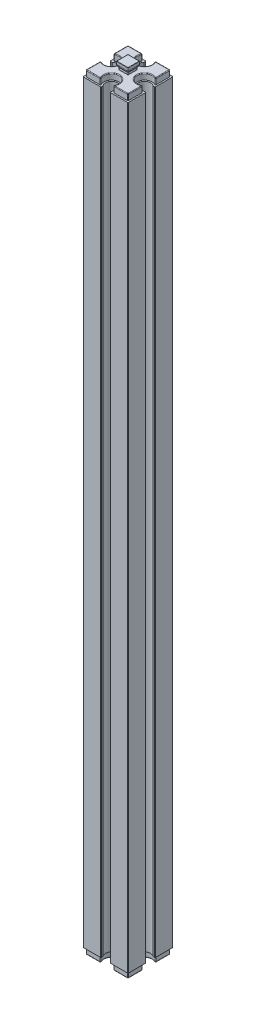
from build123d import *

# Parameters (mm, degrees)
EXTRUDE_1_DEPTH        = 125.5
EXTRUDE_2_DEPTH        = 2
EXTRUDE_3_DEPTH        = 2
FILLET_3_R             = 0.2
CUT_EXTRUDE_1_DEPTH    = 3
FILLET_4_R             = 0.2
FILLET_5_R             = 0.1
FILLET_3_OF_MIRROR_1_R = 0.2
FILLET_4_OF_MIRROR_1_R = 0.2
FILLET_5_OF_MIRROR_1_R = 0.1


with BuildPart() as part:
    # Sketch 1 → Extrude 1 (new body)
    with BuildSketch(Plane(origin=(0, 0, 0), x_dir=(1, 0, 0), z_dir=(0, 1, 0))):
        with BuildLine():
            Line((-7.5, 7.5), (-1.5, 7.5))
            Line((-1.5, 7.5), (-1.5, 6.822875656))
            ThreePointArc((-1.5, 6.822875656), (0, 3.5), (1.5, 6.822875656))
            Line((1.5, 6.822875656), (1.5, 7.5))
            Line((1.5, 7.5), (7.5, 7.5))
            Line((7.5, 7.5), (7.5, 1.5))
            Line((7.5, 1.5), (6.822875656, 1.5))
            ThreePointArc((6.822875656, 1.5), (3.5, 0), (6.822875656, -1.5))
            Line((6.822875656, -1.5), (7.5, -1.5))
            Line((7.5, -1.5), (7.5, -7.5))
            Line((7.5, -7.5), (1.5, -7.5))
            Line((1.5, -7.5), (1.5, -6.822875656))
            ThreePointArc((1.5, -6.822875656), (0, -3.5), (-1.5, -6.822875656))
            Line((-1.5, -6.822875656), (-1.5, -7.5))
            Line((-1.5, -7.5), (-7.5, -7.5))
            Line((-7.5, -7.5), (-7.5, -1.5))
            Line((-7.5, -1.5), (-6.822875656, -1.5))
            ThreePointArc((-6.822875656, -1.5), (-3.5, 0), (-6.822875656, 1.5))
            Line((-6.822875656, 1.5), (-7.5, 1.5))
            Line((-7.5, 1.5), (-7.5, 7.5))
        make_face()
    extrude_1 = extrude(amount=EXTRUDE_1_DEPTH)

    # Sketch 2 → Extrude 2 (add)
    with BuildSketch(Plane(origin=(0, 125.5, 0), x_dir=(1, 0, 0), z_dir=(0, 1, 0))):
        with BuildLine():
            Line((-7, 7), (-7, 2))
            ThreePointArc((-7, 2), (-3, 0), (-7, -2))
            Line((-7, -2), (-7, -7))
            Line((-7, -7), (-2, -7))
            ThreePointArc((-2, -7), (0, -3), (2, -7))
            Line((2, -7), (7, -7))
            Line((7, -7), (7, -2))
            ThreePointArc((7, -2), (3, 0), (7, 2))
            Line((7, 2), (7, 7))
            Line((7, 7), (2, 7))
            ThreePointArc((2, 7), (0, 3), (-2, 7))
            Line((-2, 7), (-7, 7))
        make_face()
    extrude_2 = extrude(amount=EXTRUDE_2_DEPTH)

    # Sketch 3 → Extrude 3 (add, symmetric)
    with BuildSketch(Plane(origin=(0, 0, 0), x_dir=(0, 0, -1), z_dir=(1, 0, 0))):
        with BuildLine():
            Line((-1.5, 127.5), (1.5, 127.5))
            Line((1.5, 127.5), (1.5, 128.177124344))
            ThreePointArc((1.5, 128.177124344), (1.780042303, 128.588161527), (1.95, 129.055590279))
            Line((1.95, 129.055590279), (1.95, 130))
            Line((1.95, 130), (-1.95, 130))
            Line((-1.95, 130), (-1.95, 129.055590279))
            ThreePointArc((-1.95, 129.055590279), (-1.780042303, 128.588161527), (-1.5, 128.177124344))
            Line((-1.5, 128.177124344), (-1.5, 127.5))
        make_face()
    extrude_3 = extrude(amount=EXTRUDE_3_DEPTH, both=True)

    # Fillet 3
    fillet_3_edges = [part.edges().sort_by_distance(p)[0] for p in [
        (-7.5, 62.75, -7.5),
        (-1.5, 62.75, -7.5),
        (1.5, 62.75, -7.5),
        (7.5, 62.75, -7.5),
        (7.5, 62.75, -1.5),
        (7.5, 62.75, 1.5),
        (7.5, 62.75, 7.5),
        (1.5, 62.75, 7.5),
        (-1.5, 62.75, 7.5),
        (-7.5, 62.75, 7.5),
        (-7.5, 62.75, 1.5),
        (-6.822875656, 62.75, -1.5),
        (-7.5, 62.75, -1.5),
    ]]
    fillet(fillet_3_edges, radius=FILLET_3_R)

    # Sketch 4 → Cut-Extrude 1 (cut, symmetric)
    with BuildSketch(Plane.XY):
        with BuildLine():
            Line((1.95, 130), (2, 130))
            Line((2, 130), (2, 127.5))
            Line((2, 127.5), (1.5, 127.5))
            Line((1.5, 127.5), (1.5, 128.177124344))
            ThreePointArc((1.5, 128.177124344), (1.780042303, 128.588161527), (1.95, 129.055590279))
            Line((1.95, 129.055590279), (1.95, 130))
        make_face()
        with BuildLine():
            Line((-1.95, 130), (-1.95, 129.055590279))
            ThreePointArc((-1.95, 129.055590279), (-1.780042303, 128.588161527), (-1.5, 128.177124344))
            Line((-1.5, 128.177124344), (-1.5, 127.5))
            Line((-1.5, 127.5), (-2, 127.5))
            Line((-2, 127.5), (-2, 130))
            Line((-2, 130), (-1.95, 130))
        make_face()
    cut_extrude_1 = extrude(amount=CUT_EXTRUDE_1_DEPTH, both=True, mode=Mode.SUBTRACT)

    # Fillet 4
    fillet_4_edges = [part.edges().sort_by_distance(p)[0] for p in [
        (-2, 126.5, -7),
        (-7, 126.5, -7),
        (-7, 126.5, -2),
        (-7, 126.5, 2),
        (-7, 126.5, 7),
        (-2, 126.5, 7),
        (2, 126.5, 7),
        (7, 126.5, 7),
        (7, 126.5, 2),
        (7, 126.5, -2),
        (7, 126.5, -7),
        (2, 126.5, -7),
        (-4.5, 127.5, -7),
        (-7, 127.5, -4.5),
        (-3, 127.5, 0),
        (-7, 127.5, 4.5),
        (-4.5, 127.5, 7),
        (0, 127.5, 3),
        (4.5, 127.5, 7),
        (7, 127.5, 4.5),
        (3, 127.5, 0),
        (7, 127.5, -4.5),
        (4.5, 127.5, -7),
        (0, 127.5, -3),
    ]]
    fillet(fillet_4_edges, radius=FILLET_4_R)

    # Fillet 5
    fillet_5_edges = [part.edges().sort_by_distance(p)[0] for p in [
        (1.95, 130, 0),
        (0, 130, -1.95),
        (0, 130, 1.95),
        (-1.95, 130, 0),
    ]]
    fillet(fillet_5_edges, radius=FILLET_5_R)

    # Mirror 1: Extrude 1, Extrude 2, Extrude 3, Cut-Extrude 1 across Top Plane
    add(extrude_1.mirror(Plane(origin=(0, 0, 0), x_dir=(1, 0, 0), z_dir=(0, 1, 0))))
    add(extrude_2.mirror(Plane(origin=(0, 0, 0), x_dir=(1, 0, 0), z_dir=(0, 1, 0))))
    add(extrude_3.mirror(Plane(origin=(0, 0, 0), x_dir=(1, 0, 0), z_dir=(0, 1, 0))))
    add(cut_extrude_1.mirror(Plane(origin=(0, 0, 0), x_dir=(1, 0, 0), z_dir=(0, 1, 0))), mode=Mode.SUBTRACT)

    # Fillet 3 of Mirror 1
    fillet_3_of_mirror_1_edges = [part.edges().sort_by_distance(p)[0] for p in [
        (-7.5, -62.75, -7.5),
        (-1.5, -62.75, -7.5),
        (1.5, -62.75, -7.5),
        (7.5, -62.75, -7.5),
        (7.5, -62.75, -1.5),
        (7.5, -62.75, 1.5),
        (7.5, -62.75, 7.5),
        (1.5, -62.75, 7.5),
        (-1.5, -62.75, 7.5),
        (-7.5, -62.75, 7.5),
        (-7.5, -62.75, 1.5),
        (-6.822875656, -62.75, -1.5),
        (-7.5, -62.75, -1.5),
    ]]
    fillet(fillet_3_of_mirror_1_edges, radius=FILLET_3_OF_MIRROR_1_R)

    # Fillet 4 of Mirror 1
    fillet_4_of_mirror_1_edges = [part.edges().sort_by_distance(p)[0] for p in [
        (-2, -126.5, -7),
        (-7, -126.5, -7),
        (-7, -126.5, -2),
        (-7, -126.5, 2),
        (-7, -126.5, 7),
        (-2, -126.5, 7),
        (2, -126.5, 7),
        (7, -126.5, 7),
        (7, -126.5, 2),
        (7, -126.5, -2),
        (7, -126.5, -7),
        (2, -126.5, -7),
        (-4.5, -127.5, -7),
        (-7, -127.5, -4.5),
        (-3, -127.5, 0),
        (-7, -127.5, 4.5),
        (-4.5, -127.5, 7),
        (0, -127.5, 3),
        (4.5, -127.5, 7),
        (7, -127.5, 4.5),
        (3, -127.5, 0),
        (7, -127.5, -4.5),
        (4.5, -127.5, -7),
        (0, -127.5, -3),
    ]]
    fillet(fillet_4_of_mirror_1_edges, radius=FILLET_4_OF_MIRROR_1_R)

    # Fillet 5 of Mirror 1
    fillet_5_of_mirror_1_edges = [part.edges().sort_by_distance(p)[0] for p in [
        (1.95, -130, 0),
        (0, -130, -1.95),
        (0, -130, 1.95),
        (-1.95, -130, 0),
    ]]
    fillet(fillet_5_of_mirror_1_edges, radius=FILLET_5_OF_MIRROR_1_R)


solid = part.part
